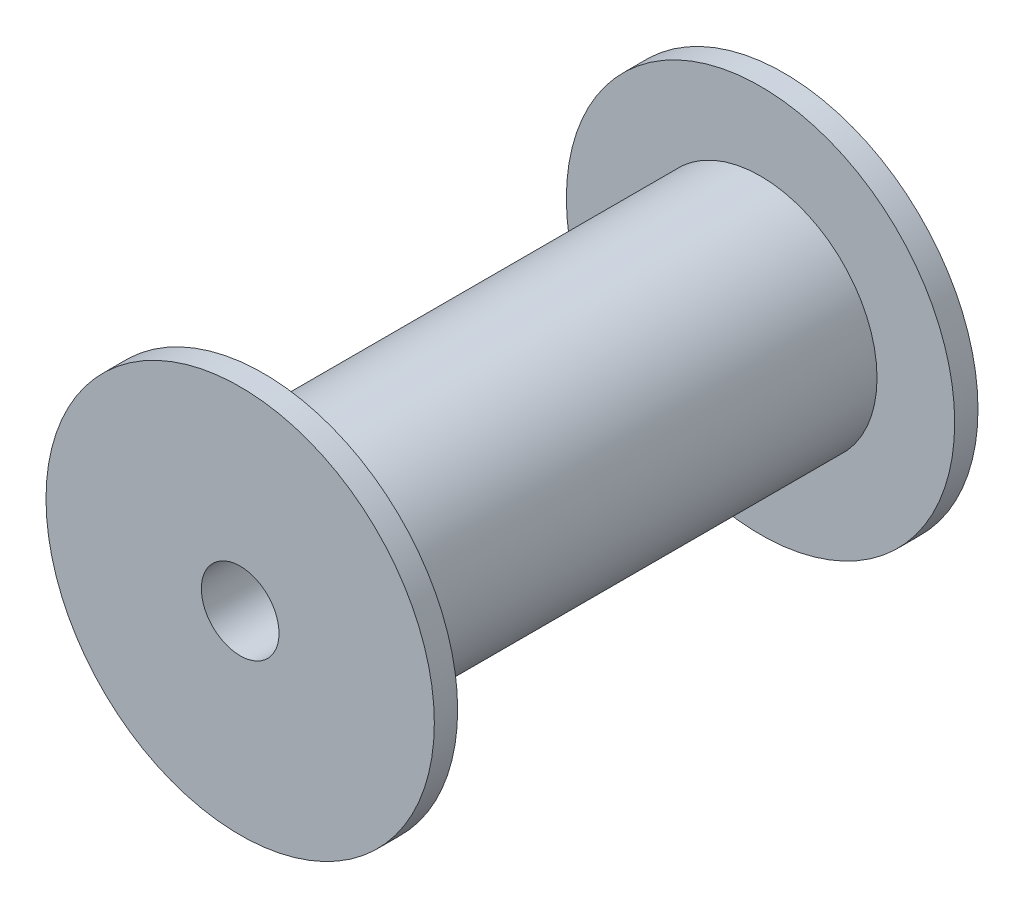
ISO-10303-21;
HEADER;
FILE_DESCRIPTION(('STEP AP214'),'2;1');
FILE_NAME('part.step','',(''),(''),'','','');
FILE_SCHEMA(('AUTOMOTIVE_DESIGN { 1 0 10303 214 1 1 1 1 }'));
ENDSEC;
DATA;
#1=APPLICATION_CONTEXT('core data for automotive mechanical design processes');
#2=APPLICATION_PROTOCOL_DEFINITION('international standard','automotive_design',2000,#1);
#3=PRODUCT_CONTEXT('',#1,'mechanical');
#4=PRODUCT('Part','Part','',(#3));
#5=PRODUCT_RELATED_PRODUCT_CATEGORY('part','',(#4));
#6=PRODUCT_DEFINITION_FORMATION('','',#4);
#7=PRODUCT_DEFINITION_CONTEXT('part definition',#1,'design');
#8=PRODUCT_DEFINITION('design','',#6,#7);
#9=PRODUCT_DEFINITION_SHAPE('','',#8);
#10=(LENGTH_UNIT() NAMED_UNIT(*) SI_UNIT(.MILLI.,.METRE.));
#11=(NAMED_UNIT(*) PLANE_ANGLE_UNIT() SI_UNIT($,.RADIAN.));
#12=(NAMED_UNIT(*) SI_UNIT($,.STERADIAN.) SOLID_ANGLE_UNIT());
#13=UNCERTAINTY_MEASURE_WITH_UNIT(LENGTH_MEASURE(1.E-05),#10,'distance_accuracy_value','');
#14=(GEOMETRIC_REPRESENTATION_CONTEXT(3) GLOBAL_UNCERTAINTY_ASSIGNED_CONTEXT((#13)) GLOBAL_UNIT_ASSIGNED_CONTEXT((#10,
#11,#12)) REPRESENTATION_CONTEXT('',''));
#15=CARTESIAN_POINT('',(0.,0.,0.));
#16=DIRECTION('',(0.,0.,1.));
#17=DIRECTION('',(1.,0.,0.));
#18=AXIS2_PLACEMENT_3D('',#15,#16,#17);
#19=CARTESIAN_POINT('',(-425.099999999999,64.9999999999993,-49.9999999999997));
#20=DIRECTION('',(0.,0.,0.999999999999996));
#21=DIRECTION('',(1.,0.,0.));
#22=AXIS2_PLACEMENT_3D('',#19,#20,#21);
#23=CYLINDRICAL_SURFACE('',#22,15.);
#24=CARTESIAN_POINT('',(-425.099999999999,64.9999999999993,-41.4999999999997));
#25=DIRECTION('',(0.,0.,0.999999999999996));
#26=DIRECTION('',(1.,0.,0.));
#27=AXIS2_PLACEMENT_3D('',#24,#25,#26);
#28=CIRCLE('',#27,15.);
#29=CARTESIAN_POINT('',(-410.099999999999,64.9999999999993,-41.4999999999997));
#30=VERTEX_POINT('',#29);
#31=EDGE_CURVE('E11',#30,#30,#28,.F.);
#32=CARTESIAN_POINT('',(-425.099999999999,64.9999999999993,22.4999999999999));
#33=DIRECTION('',(0.,0.,0.999999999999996));
#34=DIRECTION('',(1.,0.,0.));
#35=AXIS2_PLACEMENT_3D('',#32,#33,#34);
#36=CIRCLE('',#35,15.);
#37=CARTESIAN_POINT('',(-410.099999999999,64.9999999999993,22.4999999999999));
#38=VERTEX_POINT('',#37);
#39=EDGE_CURVE('E81',#38,#38,#36,.F.);
#40=CARTESIAN_POINT('',(-410.099999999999,64.9999999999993,-41.4999999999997));
#41=CARTESIAN_POINT('',(-410.099999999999,64.9999999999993,-40.8333333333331));
#42=CARTESIAN_POINT('',(-410.099999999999,64.9999999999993,-40.1666666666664));
#43=CARTESIAN_POINT('',(-410.099999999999,64.9999999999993,-38.8333333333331));
#44=CARTESIAN_POINT('',(-410.099999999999,64.9999999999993,-38.1666666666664));
#45=CARTESIAN_POINT('',(-410.099999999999,64.9999999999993,-36.8333333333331));
#46=CARTESIAN_POINT('',(-410.099999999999,64.9999999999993,-36.1666666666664));
#47=CARTESIAN_POINT('',(-410.099999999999,64.9999999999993,-34.8333333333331));
#48=CARTESIAN_POINT('',(-410.099999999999,64.9999999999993,-34.1666666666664));
#49=CARTESIAN_POINT('',(-410.099999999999,64.9999999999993,-32.8333333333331));
#50=CARTESIAN_POINT('',(-410.099999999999,64.9999999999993,-32.1666666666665));
#51=CARTESIAN_POINT('',(-410.099999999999,64.9999999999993,-30.8333333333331));
#52=CARTESIAN_POINT('',(-410.099999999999,64.9999999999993,-30.1666666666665));
#53=CARTESIAN_POINT('',(-410.099999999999,64.9999999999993,-28.8333333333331));
#54=CARTESIAN_POINT('',(-410.099999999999,64.9999999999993,-28.1666666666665));
#55=CARTESIAN_POINT('',(-410.099999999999,64.9999999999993,-26.8333333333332));
#56=CARTESIAN_POINT('',(-410.099999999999,64.9999999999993,-26.1666666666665));
#57=CARTESIAN_POINT('',(-410.099999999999,64.9999999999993,-24.8333333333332));
#58=CARTESIAN_POINT('',(-410.099999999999,64.9999999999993,-24.1666666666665));
#59=CARTESIAN_POINT('',(-410.099999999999,64.9999999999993,-22.8333333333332));
#60=CARTESIAN_POINT('',(-410.099999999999,64.9999999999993,-22.1666666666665));
#61=CARTESIAN_POINT('',(-410.099999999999,64.9999999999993,-20.8333333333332));
#62=CARTESIAN_POINT('',(-410.099999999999,64.9999999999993,-20.1666666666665));
#63=CARTESIAN_POINT('',(-410.099999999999,64.9999999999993,-18.8333333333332));
#64=CARTESIAN_POINT('',(-410.099999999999,64.9999999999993,-18.1666666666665));
#65=CARTESIAN_POINT('',(-410.099999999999,64.9999999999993,-16.8333333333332));
#66=CARTESIAN_POINT('',(-410.099999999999,64.9999999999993,-16.1666666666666));
#67=CARTESIAN_POINT('',(-410.099999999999,64.9999999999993,-14.8333333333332));
#68=CARTESIAN_POINT('',(-410.099999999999,64.9999999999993,-14.1666666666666));
#69=CARTESIAN_POINT('',(-410.099999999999,64.9999999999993,-12.8333333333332));
#70=CARTESIAN_POINT('',(-410.099999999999,64.9999999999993,-12.1666666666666));
#71=CARTESIAN_POINT('',(-410.099999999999,64.9999999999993,-10.8333333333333));
#72=CARTESIAN_POINT('',(-410.099999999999,64.9999999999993,-10.1666666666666));
#73=CARTESIAN_POINT('',(-410.099999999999,64.9999999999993,-8.83333333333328));
#74=CARTESIAN_POINT('',(-410.099999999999,64.9999999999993,-8.16666666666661));
#75=CARTESIAN_POINT('',(-410.099999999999,64.9999999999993,-6.83333333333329));
#76=CARTESIAN_POINT('',(-410.099999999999,64.9999999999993,-6.16666666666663));
#77=CARTESIAN_POINT('',(-410.099999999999,64.9999999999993,-4.8333333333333));
#78=CARTESIAN_POINT('',(-410.099999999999,64.9999999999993,-4.16666666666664));
#79=CARTESIAN_POINT('',(-410.099999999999,64.9999999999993,-2.83333333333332));
#80=CARTESIAN_POINT('',(-410.099999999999,64.9999999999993,-2.16666666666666));
#81=CARTESIAN_POINT('',(-410.099999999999,64.9999999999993,-0.833333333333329));
#82=CARTESIAN_POINT('',(-410.099999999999,64.9999999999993,-0.166666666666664));
#83=CARTESIAN_POINT('',(-410.099999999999,64.9999999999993,1.16666666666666));
#84=CARTESIAN_POINT('',(-410.099999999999,64.9999999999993,1.83333333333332));
#85=CARTESIAN_POINT('',(-410.099999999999,64.9999999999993,3.16666666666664));
#86=CARTESIAN_POINT('',(-410.099999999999,64.9999999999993,3.83333333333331));
#87=CARTESIAN_POINT('',(-410.099999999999,64.9999999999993,5.16666666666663));
#88=CARTESIAN_POINT('',(-410.099999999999,64.9999999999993,5.83333333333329));
#89=CARTESIAN_POINT('',(-410.099999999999,64.9999999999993,7.16666666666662));
#90=CARTESIAN_POINT('',(-410.099999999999,64.9999999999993,7.83333333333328));
#91=CARTESIAN_POINT('',(-410.099999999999,64.9999999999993,9.16666666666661));
#92=CARTESIAN_POINT('',(-410.099999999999,64.9999999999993,9.83333333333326));
#93=CARTESIAN_POINT('',(-410.099999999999,64.9999999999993,11.1666666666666));
#94=CARTESIAN_POINT('',(-410.099999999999,64.9999999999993,11.8333333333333));
#95=CARTESIAN_POINT('',(-410.099999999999,64.9999999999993,13.1666666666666));
#96=CARTESIAN_POINT('',(-410.099999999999,64.9999999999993,13.8333333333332));
#97=CARTESIAN_POINT('',(-410.099999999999,64.9999999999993,15.1666666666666));
#98=CARTESIAN_POINT('',(-410.099999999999,64.9999999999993,15.8333333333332));
#99=CARTESIAN_POINT('',(-410.099999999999,64.9999999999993,17.1666666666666));
#100=CARTESIAN_POINT('',(-410.099999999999,64.9999999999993,17.8333333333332));
#101=CARTESIAN_POINT('',(-410.099999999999,64.9999999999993,19.1666666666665));
#102=CARTESIAN_POINT('',(-410.099999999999,64.9999999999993,19.8333333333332));
#103=CARTESIAN_POINT('',(-410.099999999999,64.9999999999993,21.1666666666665));
#104=CARTESIAN_POINT('',(-410.099999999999,64.9999999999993,21.8333333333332));
#105=CARTESIAN_POINT('',(-410.099999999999,64.9999999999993,22.4999999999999));
#106=B_SPLINE_CURVE_WITH_KNOTS('',3,(#40,#41,#42,#43,#44,#45,#46,#47,#48,#49,#50,#51,#52,#53,
#54,#55,#56,#57,#58,#59,#60,#61,#62,#63,#64,#65,#66,#67,#68,#69,#70,#71,#72,#73,#74,#75,#76,#77,
#78,#79,#80,#81,#82,#83,#84,#85,#86,#87,#88,#89,#90,#91,#92,#93,#94,#95,#96,#97,#98,#99,#100,
#101,#102,#103,#104,#105),.UNSPECIFIED.,.F.,.F.,(4,2,2,2,2,2,2,2,2,2,2,2,2,2,2,2,2,2,2,2,2,2,2,
2,2,2,2,2,2,2,2,2,4),(0.,1.99999999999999,3.99999999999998,5.99999999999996,7.99999999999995,
9.99999999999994,11.9999999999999,13.9999999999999,15.9999999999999,17.9999999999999,
19.9999999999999,21.9999999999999,23.9999999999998,25.9999999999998,27.9999999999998,
29.9999999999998,31.9999999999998,33.9999999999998,35.9999999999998,37.9999999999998,
39.9999999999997,41.9999999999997,43.9999999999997,45.9999999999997,47.9999999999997,
49.9999999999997,51.9999999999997,53.9999999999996,55.9999999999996,57.9999999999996,
59.9999999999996,61.9999999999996,63.9999999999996),.UNSPECIFIED.);
#107=EDGE_CURVE('BSEAM62',#30,#38,#106,.T.);
#108=ORIENTED_EDGE('',*,*,#31,.F.);
#109=ORIENTED_EDGE('',*,*,#39,.T.);
#110=ORIENTED_EDGE('',*,*,#107,.T.);
#111=ORIENTED_EDGE('',*,*,#107,.F.);
#112=EDGE_LOOP('',(#108,#110,#109,#111));
#113=FACE_BOUND('',#112,.T.);
#114=ADVANCED_FACE('F62',(#113),#23,.T.);
#115=CARTESIAN_POINT('',(-425.099999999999,64.9999999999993,-49.9999999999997));
#116=DIRECTION('',(0.,0.,0.999999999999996));
#117=DIRECTION('',(1.,0.,0.));
#118=AXIS2_PLACEMENT_3D('',#115,#116,#117);
#119=CIRCLE('',#118,15.);
#120=CARTESIAN_POINT('',(-410.099999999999,64.9999999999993,-49.9999999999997));
#121=VERTEX_POINT('',#120);
#122=EDGE_CURVE('E70',#121,#121,#119,.T.);
#123=CARTESIAN_POINT('',(-425.099999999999,64.9999999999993,-44.4999999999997));
#124=DIRECTION('',(0.,0.,0.999999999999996));
#125=DIRECTION('',(1.,0.,0.));
#126=AXIS2_PLACEMENT_3D('',#123,#124,#125);
#127=CIRCLE('',#126,15.);
#128=CARTESIAN_POINT('',(-410.099999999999,64.9999999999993,-44.4999999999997));
#129=VERTEX_POINT('',#128);
#130=EDGE_CURVE('E75',#129,#129,#127,.F.);
#131=CARTESIAN_POINT('',(-410.099999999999,64.9999999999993,-49.9999999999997));
#132=CARTESIAN_POINT('',(-410.099999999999,64.9999999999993,-49.9427083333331));
#133=CARTESIAN_POINT('',(-410.099999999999,64.9999999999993,-49.8854166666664));
#134=CARTESIAN_POINT('',(-410.099999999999,64.9999999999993,-49.7708333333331));
#135=CARTESIAN_POINT('',(-410.099999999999,64.9999999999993,-49.7135416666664));
#136=CARTESIAN_POINT('',(-410.099999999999,64.9999999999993,-49.5989583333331));
#137=CARTESIAN_POINT('',(-410.099999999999,64.9999999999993,-49.5416666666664));
#138=CARTESIAN_POINT('',(-410.099999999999,64.9999999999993,-49.4270833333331));
#139=CARTESIAN_POINT('',(-410.099999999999,64.9999999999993,-49.3697916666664));
#140=CARTESIAN_POINT('',(-410.099999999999,64.9999999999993,-49.2552083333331));
#141=CARTESIAN_POINT('',(-410.099999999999,64.9999999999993,-49.1979166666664));
#142=CARTESIAN_POINT('',(-410.099999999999,64.9999999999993,-49.0833333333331));
#143=CARTESIAN_POINT('',(-410.099999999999,64.9999999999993,-49.0260416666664));
#144=CARTESIAN_POINT('',(-410.099999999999,64.9999999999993,-48.9114583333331));
#145=CARTESIAN_POINT('',(-410.099999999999,64.9999999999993,-48.8541666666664));
#146=CARTESIAN_POINT('',(-410.099999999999,64.9999999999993,-48.7395833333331));
#147=CARTESIAN_POINT('',(-410.099999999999,64.9999999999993,-48.6822916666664));
#148=CARTESIAN_POINT('',(-410.099999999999,64.9999999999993,-48.5677083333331));
#149=CARTESIAN_POINT('',(-410.099999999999,64.9999999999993,-48.5104166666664));
#150=CARTESIAN_POINT('',(-410.099999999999,64.9999999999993,-48.3958333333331));
#151=CARTESIAN_POINT('',(-410.099999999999,64.9999999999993,-48.3385416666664));
#152=CARTESIAN_POINT('',(-410.099999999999,64.9999999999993,-48.2239583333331));
#153=CARTESIAN_POINT('',(-410.099999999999,64.9999999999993,-48.1666666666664));
#154=CARTESIAN_POINT('',(-410.099999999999,64.9999999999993,-48.0520833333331));
#155=CARTESIAN_POINT('',(-410.099999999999,64.9999999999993,-47.9947916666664));
#156=CARTESIAN_POINT('',(-410.099999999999,64.9999999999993,-47.8802083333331));
#157=CARTESIAN_POINT('',(-410.099999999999,64.9999999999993,-47.8229166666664));
#158=CARTESIAN_POINT('',(-410.099999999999,64.9999999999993,-47.7083333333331));
#159=CARTESIAN_POINT('',(-410.099999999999,64.9999999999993,-47.6510416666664));
#160=CARTESIAN_POINT('',(-410.099999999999,64.9999999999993,-47.5364583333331));
#161=CARTESIAN_POINT('',(-410.099999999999,64.9999999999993,-47.4791666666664));
#162=CARTESIAN_POINT('',(-410.099999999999,64.9999999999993,-47.3645833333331));
#163=CARTESIAN_POINT('',(-410.099999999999,64.9999999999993,-47.3072916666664));
#164=CARTESIAN_POINT('',(-410.099999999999,64.9999999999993,-47.1927083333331));
#165=CARTESIAN_POINT('',(-410.099999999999,64.9999999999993,-47.1354166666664));
#166=CARTESIAN_POINT('',(-410.099999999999,64.9999999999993,-47.0208333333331));
#167=CARTESIAN_POINT('',(-410.099999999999,64.9999999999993,-46.9635416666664));
#168=CARTESIAN_POINT('',(-410.099999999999,64.9999999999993,-46.8489583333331));
#169=CARTESIAN_POINT('',(-410.099999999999,64.9999999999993,-46.7916666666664));
#170=CARTESIAN_POINT('',(-410.099999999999,64.9999999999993,-46.6770833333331));
#171=CARTESIAN_POINT('',(-410.099999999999,64.9999999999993,-46.6197916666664));
#172=CARTESIAN_POINT('',(-410.099999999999,64.9999999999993,-46.5052083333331));
#173=CARTESIAN_POINT('',(-410.099999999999,64.9999999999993,-46.4479166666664));
#174=CARTESIAN_POINT('',(-410.099999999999,64.9999999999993,-46.3333333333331));
#175=CARTESIAN_POINT('',(-410.099999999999,64.9999999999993,-46.2760416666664));
#176=CARTESIAN_POINT('',(-410.099999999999,64.9999999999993,-46.1614583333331));
#177=CARTESIAN_POINT('',(-410.099999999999,64.9999999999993,-46.1041666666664));
#178=CARTESIAN_POINT('',(-410.099999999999,64.9999999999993,-45.9895833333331));
#179=CARTESIAN_POINT('',(-410.099999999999,64.9999999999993,-45.9322916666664));
#180=CARTESIAN_POINT('',(-410.099999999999,64.9999999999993,-45.8177083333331));
#181=CARTESIAN_POINT('',(-410.099999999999,64.9999999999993,-45.7604166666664));
#182=CARTESIAN_POINT('',(-410.099999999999,64.9999999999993,-45.6458333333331));
#183=CARTESIAN_POINT('',(-410.099999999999,64.9999999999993,-45.5885416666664));
#184=CARTESIAN_POINT('',(-410.099999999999,64.9999999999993,-45.4739583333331));
#185=CARTESIAN_POINT('',(-410.099999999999,64.9999999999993,-45.4166666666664));
#186=CARTESIAN_POINT('',(-410.099999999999,64.9999999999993,-45.3020833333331));
#187=CARTESIAN_POINT('',(-410.099999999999,64.9999999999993,-45.2447916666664));
#188=CARTESIAN_POINT('',(-410.099999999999,64.9999999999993,-45.1302083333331));
#189=CARTESIAN_POINT('',(-410.099999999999,64.9999999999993,-45.0729166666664));
#190=CARTESIAN_POINT('',(-410.099999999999,64.9999999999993,-44.9583333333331));
#191=CARTESIAN_POINT('',(-410.099999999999,64.9999999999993,-44.9010416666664));
#192=CARTESIAN_POINT('',(-410.099999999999,64.9999999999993,-44.7864583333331));
#193=CARTESIAN_POINT('',(-410.099999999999,64.9999999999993,-44.7291666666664));
#194=CARTESIAN_POINT('',(-410.099999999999,64.9999999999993,-44.6145833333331));
#195=CARTESIAN_POINT('',(-410.099999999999,64.9999999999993,-44.5572916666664));
#196=CARTESIAN_POINT('',(-410.099999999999,64.9999999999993,-44.4999999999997));
#197=B_SPLINE_CURVE_WITH_KNOTS('',3,(#131,#132,#133,#134,#135,#136,#137,#138,#139,#140,#141,
#142,#143,#144,#145,#146,#147,#148,#149,#150,#151,#152,#153,#154,#155,#156,#157,#158,#159,#160,
#161,#162,#163,#164,#165,#166,#167,#168,#169,#170,#171,#172,#173,#174,#175,#176,#177,#178,#179,
#180,#181,#182,#183,#184,#185,#186,#187,#188,#189,#190,#191,#192,#193,#194,#195,#196),
.UNSPECIFIED.,.F.,.F.,(4,2,2,2,2,2,2,2,2,2,2,2,2,2,2,2,2,2,2,2,2,2,2,2,2,2,2,2,2,2,2,2,4),(0.,
0.171875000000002,0.343750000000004,0.515625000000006,0.687500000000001,0.859375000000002,
1.03125,1.20312500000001,1.37500000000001,1.546875,1.71875,1.89062500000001,2.0625,2.234375,
2.40625000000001,2.57812500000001,2.75000000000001,2.921875,3.09375000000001,3.26562500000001,
3.4375,3.609375,3.78125000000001,3.95312500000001,4.12500000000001,4.29687500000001,
4.46875000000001,4.64062500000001,4.8125,4.98437500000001,5.15625000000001,5.32812500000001,
5.50000000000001),.UNSPECIFIED.);
#198=EDGE_CURVE('BSEAM120',#121,#129,#197,.T.);
#199=ORIENTED_EDGE('',*,*,#122,.T.);
#200=ORIENTED_EDGE('',*,*,#130,.T.);
#201=ORIENTED_EDGE('',*,*,#198,.T.);
#202=ORIENTED_EDGE('',*,*,#198,.F.);
#203=EDGE_LOOP('',(#199,#201,#200,#202));
#204=FACE_BOUND('',#203,.T.);
#205=ADVANCED_FACE('F120',(#204),#23,.T.);
#206=CARTESIAN_POINT('',(-425.099999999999,64.9999999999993,-49.9999999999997));
#207=DIRECTION('',(0.,0.,0.999999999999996));
#208=DIRECTION('',(1.,0.,0.));
#209=AXIS2_PLACEMENT_3D('',#206,#207,#208);
#210=PLANE('',#209);
#211=CARTESIAN_POINT('',(-425.099999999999,64.9999999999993,-49.9999999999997));
#212=DIRECTION('',(0.,0.,0.999999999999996));
#213=DIRECTION('',(1.,0.,0.));
#214=AXIS2_PLACEMENT_3D('',#211,#212,#213);
#215=CIRCLE('',#214,13.);
#216=CARTESIAN_POINT('',(-412.099999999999,64.9999999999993,-49.9999999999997));
#217=VERTEX_POINT('',#216);
#218=EDGE_CURVE('E165',#217,#217,#215,.T.);
#219=ORIENTED_EDGE('',*,*,#218,.T.);
#220=EDGE_LOOP('',(#219));
#221=FACE_BOUND('',#220,.T.);
#222=ORIENTED_EDGE('',*,*,#122,.F.);
#223=EDGE_LOOP('',(#222));
#224=FACE_BOUND('',#223,.T.);
#225=ADVANCED_FACE('F64',(#221,#224),#210,.F.);
#226=CARTESIAN_POINT('',(-425.099999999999,64.9999999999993,-44.4999999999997));
#227=DIRECTION('',(0.,0.,0.999999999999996));
#228=DIRECTION('',(1.,0.,0.));
#229=AXIS2_PLACEMENT_3D('',#226,#227,#228);
#230=PLANE('',#229);
#231=ORIENTED_EDGE('',*,*,#130,.F.);
#232=EDGE_LOOP('',(#231));
#233=FACE_BOUND('',#232,.T.);
#234=CARTESIAN_POINT('',(-425.099999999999,64.9999999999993,-44.4999999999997));
#235=DIRECTION('',(0.,0.,0.999999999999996));
#236=DIRECTION('',(1.,0.,0.));
#237=AXIS2_PLACEMENT_3D('',#234,#235,#236);
#238=CIRCLE('',#237,25.);
#239=CARTESIAN_POINT('',(-400.099999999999,64.9999999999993,-44.4999999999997));
#240=VERTEX_POINT('',#239);
#241=EDGE_CURVE('E83',#240,#240,#238,.T.);
#242=ORIENTED_EDGE('',*,*,#241,.F.);
#243=EDGE_LOOP('',(#242));
#244=FACE_BOUND('',#243,.T.);
#245=ADVANCED_FACE('F110',(#233,#244),#230,.F.);
#246=CARTESIAN_POINT('',(-425.099999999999,64.9999999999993,-41.4999999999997));
#247=DIRECTION('',(0.,0.,0.999999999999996));
#248=DIRECTION('',(1.,0.,0.));
#249=AXIS2_PLACEMENT_3D('',#246,#247,#248);
#250=PLANE('',#249);
#251=ORIENTED_EDGE('',*,*,#31,.T.);
#252=EDGE_LOOP('',(#251));
#253=FACE_BOUND('',#252,.T.);
#254=CARTESIAN_POINT('',(-425.099999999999,64.9999999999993,-41.4999999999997));
#255=DIRECTION('',(0.,0.,0.999999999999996));
#256=DIRECTION('',(1.,0.,0.));
#257=AXIS2_PLACEMENT_3D('',#254,#255,#256);
#258=CIRCLE('',#257,25.);
#259=CARTESIAN_POINT('',(-400.099999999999,64.9999999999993,-41.4999999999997));
#260=VERTEX_POINT('',#259);
#261=EDGE_CURVE('E80',#260,#260,#258,.T.);
#262=ORIENTED_EDGE('',*,*,#261,.T.);
#263=EDGE_LOOP('',(#262));
#264=FACE_BOUND('',#263,.T.);
#265=ADVANCED_FACE('F101',(#253,#264),#250,.T.);
#266=CARTESIAN_POINT('',(-425.099999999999,64.9999999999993,-44.4999999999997));
#267=DIRECTION('',(0.,0.,0.999999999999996));
#268=DIRECTION('',(1.,0.,0.));
#269=AXIS2_PLACEMENT_3D('',#266,#267,#268);
#270=CYLINDRICAL_SURFACE('',#269,25.);
#271=CARTESIAN_POINT('',(-400.099999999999,64.9999999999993,-41.4999999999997));
#272=CARTESIAN_POINT('',(-400.099999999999,64.9999999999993,-41.5312499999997));
#273=CARTESIAN_POINT('',(-400.099999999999,64.9999999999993,-41.5624999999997));
#274=CARTESIAN_POINT('',(-400.099999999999,64.9999999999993,-41.6249999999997));
#275=CARTESIAN_POINT('',(-400.099999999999,64.9999999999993,-41.6562499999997));
#276=CARTESIAN_POINT('',(-400.099999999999,64.9999999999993,-41.7187499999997));
#277=CARTESIAN_POINT('',(-400.099999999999,64.9999999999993,-41.7499999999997));
#278=CARTESIAN_POINT('',(-400.099999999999,64.9999999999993,-41.8124999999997));
#279=CARTESIAN_POINT('',(-400.099999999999,64.9999999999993,-41.8437499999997));
#280=CARTESIAN_POINT('',(-400.099999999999,64.9999999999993,-41.9062499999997));
#281=CARTESIAN_POINT('',(-400.099999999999,64.9999999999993,-41.9374999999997));
#282=CARTESIAN_POINT('',(-400.099999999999,64.9999999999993,-41.9999999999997));
#283=CARTESIAN_POINT('',(-400.099999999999,64.9999999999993,-42.0312499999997));
#284=CARTESIAN_POINT('',(-400.099999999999,64.9999999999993,-42.0937499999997));
#285=CARTESIAN_POINT('',(-400.099999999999,64.9999999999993,-42.1249999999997));
#286=CARTESIAN_POINT('',(-400.099999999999,64.9999999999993,-42.1874999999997));
#287=CARTESIAN_POINT('',(-400.099999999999,64.9999999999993,-42.2187499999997));
#288=CARTESIAN_POINT('',(-400.099999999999,64.9999999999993,-42.2812499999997));
#289=CARTESIAN_POINT('',(-400.099999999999,64.9999999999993,-42.3124999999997));
#290=CARTESIAN_POINT('',(-400.099999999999,64.9999999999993,-42.3749999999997));
#291=CARTESIAN_POINT('',(-400.099999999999,64.9999999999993,-42.4062499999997));
#292=CARTESIAN_POINT('',(-400.099999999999,64.9999999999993,-42.4687499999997));
#293=CARTESIAN_POINT('',(-400.099999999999,64.9999999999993,-42.4999999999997));
#294=CARTESIAN_POINT('',(-400.099999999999,64.9999999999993,-42.5624999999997));
#295=CARTESIAN_POINT('',(-400.099999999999,64.9999999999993,-42.5937499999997));
#296=CARTESIAN_POINT('',(-400.099999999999,64.9999999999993,-42.6562499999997));
#297=CARTESIAN_POINT('',(-400.099999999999,64.9999999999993,-42.6874999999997));
#298=CARTESIAN_POINT('',(-400.099999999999,64.9999999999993,-42.7499999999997));
#299=CARTESIAN_POINT('',(-400.099999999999,64.9999999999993,-42.7812499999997));
#300=CARTESIAN_POINT('',(-400.099999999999,64.9999999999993,-42.8437499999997));
#301=CARTESIAN_POINT('',(-400.099999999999,64.9999999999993,-42.8749999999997));
#302=CARTESIAN_POINT('',(-400.099999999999,64.9999999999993,-42.9374999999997));
#303=CARTESIAN_POINT('',(-400.099999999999,64.9999999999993,-42.9687499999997));
#304=CARTESIAN_POINT('',(-400.099999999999,64.9999999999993,-43.0312499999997));
#305=CARTESIAN_POINT('',(-400.099999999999,64.9999999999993,-43.0624999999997));
#306=CARTESIAN_POINT('',(-400.099999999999,64.9999999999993,-43.1249999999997));
#307=CARTESIAN_POINT('',(-400.099999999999,64.9999999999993,-43.1562499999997));
#308=CARTESIAN_POINT('',(-400.099999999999,64.9999999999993,-43.2187499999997));
#309=CARTESIAN_POINT('',(-400.099999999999,64.9999999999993,-43.2499999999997));
#310=CARTESIAN_POINT('',(-400.099999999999,64.9999999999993,-43.3124999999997));
#311=CARTESIAN_POINT('',(-400.099999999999,64.9999999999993,-43.3437499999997));
#312=CARTESIAN_POINT('',(-400.099999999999,64.9999999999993,-43.4062499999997));
#313=CARTESIAN_POINT('',(-400.099999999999,64.9999999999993,-43.4374999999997));
#314=CARTESIAN_POINT('',(-400.099999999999,64.9999999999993,-43.4999999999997));
#315=CARTESIAN_POINT('',(-400.099999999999,64.9999999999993,-43.5312499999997));
#316=CARTESIAN_POINT('',(-400.099999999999,64.9999999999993,-43.5937499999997));
#317=CARTESIAN_POINT('',(-400.099999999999,64.9999999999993,-43.6249999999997));
#318=CARTESIAN_POINT('',(-400.099999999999,64.9999999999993,-43.6874999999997));
#319=CARTESIAN_POINT('',(-400.099999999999,64.9999999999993,-43.7187499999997));
#320=CARTESIAN_POINT('',(-400.099999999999,64.9999999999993,-43.7812499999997));
#321=CARTESIAN_POINT('',(-400.099999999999,64.9999999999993,-43.8124999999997));
#322=CARTESIAN_POINT('',(-400.099999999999,64.9999999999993,-43.8749999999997));
#323=CARTESIAN_POINT('',(-400.099999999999,64.9999999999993,-43.9062499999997));
#324=CARTESIAN_POINT('',(-400.099999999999,64.9999999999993,-43.9687499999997));
#325=CARTESIAN_POINT('',(-400.099999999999,64.9999999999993,-43.9999999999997));
#326=CARTESIAN_POINT('',(-400.099999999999,64.9999999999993,-44.0624999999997));
#327=CARTESIAN_POINT('',(-400.099999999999,64.9999999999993,-44.0937499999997));
#328=CARTESIAN_POINT('',(-400.099999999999,64.9999999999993,-44.1562499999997));
#329=CARTESIAN_POINT('',(-400.099999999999,64.9999999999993,-44.1874999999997));
#330=CARTESIAN_POINT('',(-400.099999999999,64.9999999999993,-44.2499999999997));
#331=CARTESIAN_POINT('',(-400.099999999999,64.9999999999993,-44.2812499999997));
#332=CARTESIAN_POINT('',(-400.099999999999,64.9999999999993,-44.3437499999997));
#333=CARTESIAN_POINT('',(-400.099999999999,64.9999999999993,-44.3749999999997));
#334=CARTESIAN_POINT('',(-400.099999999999,64.9999999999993,-44.4374999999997));
#335=CARTESIAN_POINT('',(-400.099999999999,64.9999999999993,-44.4687499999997));
#336=CARTESIAN_POINT('',(-400.099999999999,64.9999999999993,-44.4999999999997));
#337=B_SPLINE_CURVE_WITH_KNOTS('',3,(#271,#272,#273,#274,#275,#276,#277,#278,#279,#280,#281,
#282,#283,#284,#285,#286,#287,#288,#289,#290,#291,#292,#293,#294,#295,#296,#297,#298,#299,#300,
#301,#302,#303,#304,#305,#306,#307,#308,#309,#310,#311,#312,#313,#314,#315,#316,#317,#318,#319,
#320,#321,#322,#323,#324,#325,#326,#327,#328,#329,#330,#331,#332,#333,#334,#335,#336),
.UNSPECIFIED.,.F.,.F.,(4,2,2,2,2,2,2,2,2,2,2,2,2,2,2,2,2,2,2,2,2,2,2,2,2,2,2,2,2,2,2,2,4),(0.,
0.0937500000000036,0.1875,0.281250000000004,0.375,0.468750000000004,0.5625,0.656250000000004,
0.750000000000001,0.843750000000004,0.937500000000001,1.03125,1.125,1.21875,1.3125,1.40625,1.5,
1.59375,1.6875,1.78125,1.875,1.96875,2.0625,2.15625,2.25,2.34375,2.4375,2.53125,2.625,2.71875,
2.8125,2.90625,3.),.UNSPECIFIED.);
#338=EDGE_CURVE('BSEAM103',#260,#240,#337,.T.);
#339=ORIENTED_EDGE('',*,*,#261,.F.);
#340=ORIENTED_EDGE('',*,*,#241,.T.);
#341=ORIENTED_EDGE('',*,*,#338,.T.);
#342=ORIENTED_EDGE('',*,*,#338,.F.);
#343=EDGE_LOOP('',(#339,#341,#340,#342));
#344=FACE_BOUND('',#343,.T.);
#345=ADVANCED_FACE('F103',(#344),#270,.T.);
#346=CARTESIAN_POINT('',(-425.099999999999,64.9999999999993,22.4999999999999));
#347=DIRECTION('',(0.,0.,0.999999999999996));
#348=DIRECTION('',(1.,0.,0.));
#349=AXIS2_PLACEMENT_3D('',#346,#347,#348);
#350=PLANE('',#349);
#351=ORIENTED_EDGE('',*,*,#39,.F.);
#352=EDGE_LOOP('',(#351));
#353=FACE_BOUND('',#352,.T.);
#354=CARTESIAN_POINT('',(-425.099999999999,64.9999999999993,22.4999999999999));
#355=DIRECTION('',(0.,0.,0.999999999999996));
#356=DIRECTION('',(1.,0.,0.));
#357=AXIS2_PLACEMENT_3D('',#354,#355,#356);
#358=CIRCLE('',#357,25.);
#359=CARTESIAN_POINT('',(-400.099999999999,64.9999999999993,22.4999999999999));
#360=VERTEX_POINT('',#359);
#361=EDGE_CURVE('E90',#360,#360,#358,.T.);
#362=ORIENTED_EDGE('',*,*,#361,.F.);
#363=EDGE_LOOP('',(#362));
#364=FACE_BOUND('',#363,.T.);
#365=ADVANCED_FACE('F106',(#353,#364),#350,.F.);
#366=CARTESIAN_POINT('',(-425.099999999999,64.9999999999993,22.4999999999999));
#367=DIRECTION('',(0.,0.,0.999999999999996));
#368=DIRECTION('',(1.,0.,0.));
#369=AXIS2_PLACEMENT_3D('',#366,#367,#368);
#370=CYLINDRICAL_SURFACE('',#369,25.);
#371=CARTESIAN_POINT('',(-425.099999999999,64.9999999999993,25.4999999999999));
#372=DIRECTION('',(0.,0.,0.999999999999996));
#373=DIRECTION('',(1.,0.,0.));
#374=AXIS2_PLACEMENT_3D('',#371,#372,#373);
#375=CIRCLE('',#374,25.);
#376=CARTESIAN_POINT('',(-400.099999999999,64.9999999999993,25.4999999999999));
#377=VERTEX_POINT('',#376);
#378=EDGE_CURVE('E84',#377,#377,#375,.T.);
#379=CARTESIAN_POINT('',(-400.099999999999,64.9999999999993,25.4999999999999));
#380=CARTESIAN_POINT('',(-400.099999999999,64.9999999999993,25.4687499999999));
#381=CARTESIAN_POINT('',(-400.099999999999,64.9999999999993,25.4374999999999));
#382=CARTESIAN_POINT('',(-400.099999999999,64.9999999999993,25.3749999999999));
#383=CARTESIAN_POINT('',(-400.099999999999,64.9999999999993,25.3437499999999));
#384=CARTESIAN_POINT('',(-400.099999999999,64.9999999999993,25.2812499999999));
#385=CARTESIAN_POINT('',(-400.099999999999,64.9999999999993,25.2499999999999));
#386=CARTESIAN_POINT('',(-400.099999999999,64.9999999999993,25.1874999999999));
#387=CARTESIAN_POINT('',(-400.099999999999,64.9999999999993,25.1562499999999));
#388=CARTESIAN_POINT('',(-400.099999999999,64.9999999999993,25.0937499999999));
#389=CARTESIAN_POINT('',(-400.099999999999,64.9999999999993,25.0624999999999));
#390=CARTESIAN_POINT('',(-400.099999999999,64.9999999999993,24.9999999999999));
#391=CARTESIAN_POINT('',(-400.099999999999,64.9999999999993,24.9687499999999));
#392=CARTESIAN_POINT('',(-400.099999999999,64.9999999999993,24.9062499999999));
#393=CARTESIAN_POINT('',(-400.099999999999,64.9999999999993,24.8749999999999));
#394=CARTESIAN_POINT('',(-400.099999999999,64.9999999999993,24.8124999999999));
#395=CARTESIAN_POINT('',(-400.099999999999,64.9999999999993,24.7812499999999));
#396=CARTESIAN_POINT('',(-400.099999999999,64.9999999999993,24.7187499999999));
#397=CARTESIAN_POINT('',(-400.099999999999,64.9999999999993,24.6874999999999));
#398=CARTESIAN_POINT('',(-400.099999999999,64.9999999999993,24.6249999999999));
#399=CARTESIAN_POINT('',(-400.099999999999,64.9999999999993,24.5937499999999));
#400=CARTESIAN_POINT('',(-400.099999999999,64.9999999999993,24.5312499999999));
#401=CARTESIAN_POINT('',(-400.099999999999,64.9999999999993,24.4999999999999));
#402=CARTESIAN_POINT('',(-400.099999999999,64.9999999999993,24.4374999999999));
#403=CARTESIAN_POINT('',(-400.099999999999,64.9999999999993,24.4062499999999));
#404=CARTESIAN_POINT('',(-400.099999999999,64.9999999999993,24.3437499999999));
#405=CARTESIAN_POINT('',(-400.099999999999,64.9999999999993,24.3124999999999));
#406=CARTESIAN_POINT('',(-400.099999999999,64.9999999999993,24.2499999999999));
#407=CARTESIAN_POINT('',(-400.099999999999,64.9999999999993,24.2187499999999));
#408=CARTESIAN_POINT('',(-400.099999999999,64.9999999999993,24.1562499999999));
#409=CARTESIAN_POINT('',(-400.099999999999,64.9999999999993,24.1249999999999));
#410=CARTESIAN_POINT('',(-400.099999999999,64.9999999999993,24.0624999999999));
#411=CARTESIAN_POINT('',(-400.099999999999,64.9999999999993,24.0312499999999));
#412=CARTESIAN_POINT('',(-400.099999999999,64.9999999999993,23.9687499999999));
#413=CARTESIAN_POINT('',(-400.099999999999,64.9999999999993,23.9374999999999));
#414=CARTESIAN_POINT('',(-400.099999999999,64.9999999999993,23.8749999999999));
#415=CARTESIAN_POINT('',(-400.099999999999,64.9999999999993,23.8437499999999));
#416=CARTESIAN_POINT('',(-400.099999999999,64.9999999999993,23.7812499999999));
#417=CARTESIAN_POINT('',(-400.099999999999,64.9999999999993,23.7499999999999));
#418=CARTESIAN_POINT('',(-400.099999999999,64.9999999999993,23.6874999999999));
#419=CARTESIAN_POINT('',(-400.099999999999,64.9999999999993,23.6562499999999));
#420=CARTESIAN_POINT('',(-400.099999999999,64.9999999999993,23.5937499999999));
#421=CARTESIAN_POINT('',(-400.099999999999,64.9999999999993,23.5624999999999));
#422=CARTESIAN_POINT('',(-400.099999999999,64.9999999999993,23.4999999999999));
#423=CARTESIAN_POINT('',(-400.099999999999,64.9999999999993,23.4687499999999));
#424=CARTESIAN_POINT('',(-400.099999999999,64.9999999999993,23.4062499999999));
#425=CARTESIAN_POINT('',(-400.099999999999,64.9999999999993,23.3749999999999));
#426=CARTESIAN_POINT('',(-400.099999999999,64.9999999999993,23.3124999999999));
#427=CARTESIAN_POINT('',(-400.099999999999,64.9999999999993,23.2812499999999));
#428=CARTESIAN_POINT('',(-400.099999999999,64.9999999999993,23.2187499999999));
#429=CARTESIAN_POINT('',(-400.099999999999,64.9999999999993,23.1874999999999));
#430=CARTESIAN_POINT('',(-400.099999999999,64.9999999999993,23.1249999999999));
#431=CARTESIAN_POINT('',(-400.099999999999,64.9999999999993,23.0937499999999));
#432=CARTESIAN_POINT('',(-400.099999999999,64.9999999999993,23.0312499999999));
#433=CARTESIAN_POINT('',(-400.099999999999,64.9999999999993,22.9999999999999));
#434=CARTESIAN_POINT('',(-400.099999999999,64.9999999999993,22.9374999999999));
#435=CARTESIAN_POINT('',(-400.099999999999,64.9999999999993,22.9062499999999));
#436=CARTESIAN_POINT('',(-400.099999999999,64.9999999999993,22.8437499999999));
#437=CARTESIAN_POINT('',(-400.099999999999,64.9999999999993,22.8124999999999));
#438=CARTESIAN_POINT('',(-400.099999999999,64.9999999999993,22.7499999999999));
#439=CARTESIAN_POINT('',(-400.099999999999,64.9999999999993,22.7187499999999));
#440=CARTESIAN_POINT('',(-400.099999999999,64.9999999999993,22.6562499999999));
#441=CARTESIAN_POINT('',(-400.099999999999,64.9999999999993,22.6249999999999));
#442=CARTESIAN_POINT('',(-400.099999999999,64.9999999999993,22.5624999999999));
#443=CARTESIAN_POINT('',(-400.099999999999,64.9999999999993,22.5312499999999));
#444=CARTESIAN_POINT('',(-400.099999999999,64.9999999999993,22.4999999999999));
#445=B_SPLINE_CURVE_WITH_KNOTS('',3,(#379,#380,#381,#382,#383,#384,#385,#386,#387,#388,#389,
#390,#391,#392,#393,#394,#395,#396,#397,#398,#399,#400,#401,#402,#403,#404,#405,#406,#407,#408,
#409,#410,#411,#412,#413,#414,#415,#416,#417,#418,#419,#420,#421,#422,#423,#424,#425,#426,#427,
#428,#429,#430,#431,#432,#433,#434,#435,#436,#437,#438,#439,#440,#441,#442,#443,#444),
.UNSPECIFIED.,.F.,.F.,(4,2,2,2,2,2,2,2,2,2,2,2,2,2,2,2,2,2,2,2,2,2,2,2,2,2,2,2,2,2,2,2,4),(0.,
0.0937500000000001,0.1875,0.28125,0.375,0.46875,0.5625,0.656250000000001,0.750000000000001,
0.843750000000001,0.937500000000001,1.03125,1.125,1.21875,1.3125,1.40625,1.5,1.59375,1.6875,
1.78125,1.875,1.96875,2.0625,2.15625,2.25,2.34375,2.4375,2.53125,2.625,2.71875,2.8125,2.90625,
3.),.UNSPECIFIED.);
#446=EDGE_CURVE('BSEAM114',#377,#360,#445,.T.);
#447=ORIENTED_EDGE('',*,*,#378,.F.);
#448=ORIENTED_EDGE('',*,*,#361,.T.);
#449=ORIENTED_EDGE('',*,*,#446,.T.);
#450=ORIENTED_EDGE('',*,*,#446,.F.);
#451=EDGE_LOOP('',(#447,#449,#448,#450));
#452=FACE_BOUND('',#451,.T.);
#453=ADVANCED_FACE('F114',(#452),#370,.T.);
#454=CARTESIAN_POINT('',(-425.099999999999,64.9999999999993,25.4999999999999));
#455=DIRECTION('',(0.,0.,0.999999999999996));
#456=DIRECTION('',(1.,0.,0.));
#457=AXIS2_PLACEMENT_3D('',#454,#455,#456);
#458=PLANE('',#457);
#459=CARTESIAN_POINT('',(-425.099999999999,64.9999999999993,25.4999999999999));
#460=DIRECTION('',(0.,0.,0.999999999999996));
#461=DIRECTION('',(1.,0.,0.));
#462=AXIS2_PLACEMENT_3D('',#459,#460,#461);
#463=CIRCLE('',#462,5.);
#464=CARTESIAN_POINT('',(-420.099999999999,64.9999999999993,25.4999999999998));
#465=VERTEX_POINT('',#464);
#466=EDGE_CURVE('E95',#465,#465,#463,.T.);
#467=ORIENTED_EDGE('',*,*,#466,.F.);
#468=EDGE_LOOP('',(#467));
#469=FACE_BOUND('',#468,.T.);
#470=ORIENTED_EDGE('',*,*,#378,.T.);
#471=EDGE_LOOP('',(#470));
#472=FACE_BOUND('',#471,.T.);
#473=ADVANCED_FACE('F125',(#469,#472),#458,.T.);
#474=CARTESIAN_POINT('',(-425.099999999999,64.9999999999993,-49.9999999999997));
#475=DIRECTION('',(0.,0.,0.999999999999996));
#476=DIRECTION('',(1.,0.,0.));
#477=AXIS2_PLACEMENT_3D('',#474,#475,#476);
#478=CYLINDRICAL_SURFACE('',#477,5.);
#479=CARTESIAN_POINT('',(-425.099999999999,64.9999999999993,-41.9999999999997));
#480=DIRECTION('',(0.,0.,0.999999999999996));
#481=DIRECTION('',(1.,0.,0.));
#482=AXIS2_PLACEMENT_3D('',#479,#480,#481);
#483=CIRCLE('',#482,5.);
#484=CARTESIAN_POINT('',(-420.099999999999,64.9999999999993,-41.9999999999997));
#485=VERTEX_POINT('',#484);
#486=EDGE_CURVE('E66',#485,#485,#483,.F.);
#487=CARTESIAN_POINT('',(-420.099999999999,64.9999999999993,-41.9999999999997));
#488=CARTESIAN_POINT('',(-420.099999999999,64.9999999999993,-41.2968749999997));
#489=CARTESIAN_POINT('',(-420.099999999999,64.9999999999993,-40.5937499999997));
#490=CARTESIAN_POINT('',(-420.099999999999,64.9999999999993,-39.1874999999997));
#491=CARTESIAN_POINT('',(-420.099999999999,64.9999999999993,-38.4843749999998));
#492=CARTESIAN_POINT('',(-420.099999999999,64.9999999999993,-37.0781249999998));
#493=CARTESIAN_POINT('',(-420.099999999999,64.9999999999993,-36.3749999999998));
#494=CARTESIAN_POINT('',(-420.099999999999,64.9999999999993,-34.9687499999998));
#495=CARTESIAN_POINT('',(-420.099999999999,64.9999999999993,-34.2656249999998));
#496=CARTESIAN_POINT('',(-420.099999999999,64.9999999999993,-32.8593749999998));
#497=CARTESIAN_POINT('',(-420.099999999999,64.9999999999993,-32.1562499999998));
#498=CARTESIAN_POINT('',(-420.099999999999,64.9999999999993,-30.7499999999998));
#499=CARTESIAN_POINT('',(-420.099999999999,64.9999999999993,-30.0468749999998));
#500=CARTESIAN_POINT('',(-420.099999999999,64.9999999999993,-28.6406249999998));
#501=CARTESIAN_POINT('',(-420.099999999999,64.9999999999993,-27.9374999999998));
#502=CARTESIAN_POINT('',(-420.099999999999,64.9999999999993,-26.5312499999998));
#503=CARTESIAN_POINT('',(-420.099999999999,64.9999999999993,-25.8281249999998));
#504=CARTESIAN_POINT('',(-420.099999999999,64.9999999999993,-24.4218749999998));
#505=CARTESIAN_POINT('',(-420.099999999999,64.9999999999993,-23.7187499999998));
#506=CARTESIAN_POINT('',(-420.099999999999,64.9999999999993,-22.3124999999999));
#507=CARTESIAN_POINT('',(-420.099999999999,64.9999999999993,-21.6093749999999));
#508=CARTESIAN_POINT('',(-420.099999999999,64.9999999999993,-20.2031249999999));
#509=CARTESIAN_POINT('',(-420.099999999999,64.9999999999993,-19.4999999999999));
#510=CARTESIAN_POINT('',(-420.099999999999,64.9999999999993,-18.0937499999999));
#511=CARTESIAN_POINT('',(-420.099999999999,64.9999999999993,-17.3906249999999));
#512=CARTESIAN_POINT('',(-420.099999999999,64.9999999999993,-15.9843749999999));
#513=CARTESIAN_POINT('',(-420.099999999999,64.9999999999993,-15.2812499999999));
#514=CARTESIAN_POINT('',(-420.099999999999,64.9999999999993,-13.8749999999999));
#515=CARTESIAN_POINT('',(-420.099999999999,64.9999999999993,-13.1718749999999));
#516=CARTESIAN_POINT('',(-420.099999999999,64.9999999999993,-11.7656249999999));
#517=CARTESIAN_POINT('',(-420.099999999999,64.9999999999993,-11.0624999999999));
#518=CARTESIAN_POINT('',(-420.099999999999,64.9999999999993,-9.65624999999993));
#519=CARTESIAN_POINT('',(-420.099999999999,64.9999999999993,-8.95312499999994));
#520=CARTESIAN_POINT('',(-420.099999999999,64.9999999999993,-7.54687499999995));
#521=CARTESIAN_POINT('',(-420.099999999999,64.9999999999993,-6.84374999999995));
#522=CARTESIAN_POINT('',(-420.099999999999,64.9999999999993,-5.43749999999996));
#523=CARTESIAN_POINT('',(-420.099999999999,64.9999999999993,-4.73437499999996));
#524=CARTESIAN_POINT('',(-420.099999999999,64.9999999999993,-3.32812499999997));
#525=CARTESIAN_POINT('',(-420.099999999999,64.9999999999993,-2.62499999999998));
#526=CARTESIAN_POINT('',(-420.099999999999,64.9999999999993,-1.21874999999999));
#527=CARTESIAN_POINT('',(-420.099999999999,64.9999999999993,-0.515624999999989));
#528=CARTESIAN_POINT('',(-420.099999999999,64.9999999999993,0.890624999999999));
#529=CARTESIAN_POINT('',(-420.099999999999,64.9999999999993,1.59374999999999));
#530=CARTESIAN_POINT('',(-420.099999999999,64.9999999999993,2.99999999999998));
#531=CARTESIAN_POINT('',(-420.099999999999,64.9999999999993,3.70312499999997));
#532=CARTESIAN_POINT('',(-420.099999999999,64.9999999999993,5.10937499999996));
#533=CARTESIAN_POINT('',(-420.099999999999,64.9999999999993,5.81249999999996));
#534=CARTESIAN_POINT('',(-420.099999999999,64.9999999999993,7.21874999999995));
#535=CARTESIAN_POINT('',(-420.099999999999,64.9999999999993,7.92187499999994));
#536=CARTESIAN_POINT('',(-420.099999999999,64.9999999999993,9.32812499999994));
#537=CARTESIAN_POINT('',(-420.099999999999,64.9999999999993,10.0312499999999));
#538=CARTESIAN_POINT('',(-420.099999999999,64.9999999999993,11.4374999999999));
#539=CARTESIAN_POINT('',(-420.099999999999,64.9999999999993,12.1406249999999));
#540=CARTESIAN_POINT('',(-420.099999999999,64.9999999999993,13.5468749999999));
#541=CARTESIAN_POINT('',(-420.099999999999,64.9999999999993,14.2499999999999));
#542=CARTESIAN_POINT('',(-420.099999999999,64.9999999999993,15.6562499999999));
#543=CARTESIAN_POINT('',(-420.099999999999,64.9999999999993,16.3593749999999));
#544=CARTESIAN_POINT('',(-420.099999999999,64.9999999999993,17.7656249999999));
#545=CARTESIAN_POINT('',(-420.099999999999,64.9999999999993,18.4687499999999));
#546=CARTESIAN_POINT('',(-420.099999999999,64.9999999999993,19.8749999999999));
#547=CARTESIAN_POINT('',(-420.099999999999,64.9999999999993,20.5781249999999));
#548=CARTESIAN_POINT('',(-420.099999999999,64.9999999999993,21.9843749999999));
#549=CARTESIAN_POINT('',(-420.099999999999,64.9999999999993,22.6874999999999));
#550=CARTESIAN_POINT('',(-420.099999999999,64.9999999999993,24.0937499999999));
#551=CARTESIAN_POINT('',(-420.099999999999,64.9999999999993,24.7968749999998));
#552=CARTESIAN_POINT('',(-420.099999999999,64.9999999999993,25.4999999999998));
#553=B_SPLINE_CURVE_WITH_KNOTS('',3,(#487,#488,#489,#490,#491,#492,#493,#494,#495,#496,#497,
#498,#499,#500,#501,#502,#503,#504,#505,#506,#507,#508,#509,#510,#511,#512,#513,#514,#515,#516,
#517,#518,#519,#520,#521,#522,#523,#524,#525,#526,#527,#528,#529,#530,#531,#532,#533,#534,#535,
#536,#537,#538,#539,#540,#541,#542,#543,#544,#545,#546,#547,#548,#549,#550,#551,#552),
.UNSPECIFIED.,.F.,.F.,(4,2,2,2,2,2,2,2,2,2,2,2,2,2,2,2,2,2,2,2,2,2,2,2,2,2,2,2,2,2,2,2,4),(0.,
2.10937499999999,4.21874999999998,6.32812499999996,8.43749999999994,10.5468749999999,
12.6562499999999,14.7656249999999,16.8749999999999,18.9843749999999,21.0937499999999,
23.2031249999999,25.3124999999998,27.4218749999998,29.5312499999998,31.6406249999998,
33.7499999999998,35.8593749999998,37.9687499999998,40.0781249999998,42.1874999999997,
44.2968749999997,46.4062499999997,48.5156249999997,50.6249999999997,52.7343749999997,
54.8437499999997,56.9531249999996,59.0624999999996,61.1718749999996,63.2812499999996,
65.3906249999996,67.4999999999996),.UNSPECIFIED.);
#554=EDGE_CURVE('BSEAM135',#485,#465,#553,.T.);
#555=ORIENTED_EDGE('',*,*,#486,.T.);
#556=ORIENTED_EDGE('',*,*,#466,.T.);
#557=ORIENTED_EDGE('',*,*,#554,.T.);
#558=ORIENTED_EDGE('',*,*,#554,.F.);
#559=EDGE_LOOP('',(#555,#557,#556,#558));
#560=FACE_BOUND('',#559,.T.);
#561=ADVANCED_FACE('F135',(#560),#478,.F.);
#562=CARTESIAN_POINT('',(-425.099999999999,64.9999999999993,-41.9999999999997));
#563=DIRECTION('',(0.,0.,0.999999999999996));
#564=DIRECTION('',(1.,0.,0.));
#565=AXIS2_PLACEMENT_3D('',#562,#563,#564);
#566=PLANE('',#565);
#567=CARTESIAN_POINT('',(-425.099999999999,64.9999999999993,-41.9999999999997));
#568=DIRECTION('',(0.,0.,0.999999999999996));
#569=DIRECTION('',(1.,0.,0.));
#570=AXIS2_PLACEMENT_3D('',#567,#568,#569);
#571=CIRCLE('',#570,13.);
#572=CARTESIAN_POINT('',(-412.099999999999,64.9999999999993,-41.9999999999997));
#573=VERTEX_POINT('',#572);
#574=EDGE_CURVE('E162',#573,#573,#571,.T.);
#575=ORIENTED_EDGE('',*,*,#574,.F.);
#576=EDGE_LOOP('',(#575));
#577=FACE_BOUND('',#576,.T.);
#578=ORIENTED_EDGE('',*,*,#486,.F.);
#579=EDGE_LOOP('',(#578));
#580=FACE_BOUND('',#579,.T.);
#581=ADVANCED_FACE('F140',(#577,#580),#566,.F.);
#582=CARTESIAN_POINT('',(-425.099999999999,64.9999999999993,-49.9999999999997));
#583=DIRECTION('',(0.,0.,0.999999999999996));
#584=DIRECTION('',(1.,0.,0.));
#585=AXIS2_PLACEMENT_3D('',#582,#583,#584);
#586=CYLINDRICAL_SURFACE('',#585,13.);
#587=CARTESIAN_POINT('',(-412.099999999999,64.9999999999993,-41.9999999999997));
#588=CARTESIAN_POINT('',(-412.099999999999,64.9999999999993,-42.0833333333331));
#589=CARTESIAN_POINT('',(-412.099999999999,64.9999999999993,-42.1666666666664));
#590=CARTESIAN_POINT('',(-412.099999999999,64.9999999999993,-42.3333333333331));
#591=CARTESIAN_POINT('',(-412.099999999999,64.9999999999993,-42.4166666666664));
#592=CARTESIAN_POINT('',(-412.099999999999,64.9999999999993,-42.5833333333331));
#593=CARTESIAN_POINT('',(-412.099999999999,64.9999999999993,-42.6666666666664));
#594=CARTESIAN_POINT('',(-412.099999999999,64.9999999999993,-42.8333333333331));
#595=CARTESIAN_POINT('',(-412.099999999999,64.9999999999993,-42.9166666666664));
#596=CARTESIAN_POINT('',(-412.099999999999,64.9999999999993,-43.0833333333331));
#597=CARTESIAN_POINT('',(-412.099999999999,64.9999999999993,-43.1666666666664));
#598=CARTESIAN_POINT('',(-412.099999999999,64.9999999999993,-43.3333333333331));
#599=CARTESIAN_POINT('',(-412.099999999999,64.9999999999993,-43.4166666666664));
#600=CARTESIAN_POINT('',(-412.099999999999,64.9999999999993,-43.5833333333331));
#601=CARTESIAN_POINT('',(-412.099999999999,64.9999999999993,-43.6666666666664));
#602=CARTESIAN_POINT('',(-412.099999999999,64.9999999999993,-43.8333333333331));
#603=CARTESIAN_POINT('',(-412.099999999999,64.9999999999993,-43.9166666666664));
#604=CARTESIAN_POINT('',(-412.099999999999,64.9999999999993,-44.0833333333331));
#605=CARTESIAN_POINT('',(-412.099999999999,64.9999999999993,-44.1666666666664));
#606=CARTESIAN_POINT('',(-412.099999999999,64.9999999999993,-44.3333333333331));
#607=CARTESIAN_POINT('',(-412.099999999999,64.9999999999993,-44.4166666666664));
#608=CARTESIAN_POINT('',(-412.099999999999,64.9999999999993,-44.5833333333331));
#609=CARTESIAN_POINT('',(-412.099999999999,64.9999999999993,-44.6666666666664));
#610=CARTESIAN_POINT('',(-412.099999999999,64.9999999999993,-44.8333333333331));
#611=CARTESIAN_POINT('',(-412.099999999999,64.9999999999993,-44.9166666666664));
#612=CARTESIAN_POINT('',(-412.099999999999,64.9999999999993,-45.0833333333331));
#613=CARTESIAN_POINT('',(-412.099999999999,64.9999999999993,-45.1666666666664));
#614=CARTESIAN_POINT('',(-412.099999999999,64.9999999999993,-45.3333333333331));
#615=CARTESIAN_POINT('',(-412.099999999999,64.9999999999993,-45.4166666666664));
#616=CARTESIAN_POINT('',(-412.099999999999,64.9999999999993,-45.5833333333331));
#617=CARTESIAN_POINT('',(-412.099999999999,64.9999999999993,-45.6666666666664));
#618=CARTESIAN_POINT('',(-412.099999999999,64.9999999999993,-45.8333333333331));
#619=CARTESIAN_POINT('',(-412.099999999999,64.9999999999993,-45.9166666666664));
#620=CARTESIAN_POINT('',(-412.099999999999,64.9999999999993,-46.0833333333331));
#621=CARTESIAN_POINT('',(-412.099999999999,64.9999999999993,-46.1666666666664));
#622=CARTESIAN_POINT('',(-412.099999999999,64.9999999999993,-46.3333333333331));
#623=CARTESIAN_POINT('',(-412.099999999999,64.9999999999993,-46.4166666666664));
#624=CARTESIAN_POINT('',(-412.099999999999,64.9999999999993,-46.5833333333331));
#625=CARTESIAN_POINT('',(-412.099999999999,64.9999999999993,-46.6666666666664));
#626=CARTESIAN_POINT('',(-412.099999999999,64.9999999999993,-46.8333333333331));
#627=CARTESIAN_POINT('',(-412.099999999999,64.9999999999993,-46.9166666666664));
#628=CARTESIAN_POINT('',(-412.099999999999,64.9999999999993,-47.0833333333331));
#629=CARTESIAN_POINT('',(-412.099999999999,64.9999999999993,-47.1666666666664));
#630=CARTESIAN_POINT('',(-412.099999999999,64.9999999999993,-47.3333333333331));
#631=CARTESIAN_POINT('',(-412.099999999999,64.9999999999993,-47.4166666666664));
#632=CARTESIAN_POINT('',(-412.099999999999,64.9999999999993,-47.5833333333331));
#633=CARTESIAN_POINT('',(-412.099999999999,64.9999999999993,-47.6666666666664));
#634=CARTESIAN_POINT('',(-412.099999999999,64.9999999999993,-47.8333333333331));
#635=CARTESIAN_POINT('',(-412.099999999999,64.9999999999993,-47.9166666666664));
#636=CARTESIAN_POINT('',(-412.099999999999,64.9999999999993,-48.0833333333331));
#637=CARTESIAN_POINT('',(-412.099999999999,64.9999999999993,-48.1666666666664));
#638=CARTESIAN_POINT('',(-412.099999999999,64.9999999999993,-48.3333333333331));
#639=CARTESIAN_POINT('',(-412.099999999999,64.9999999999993,-48.4166666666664));
#640=CARTESIAN_POINT('',(-412.099999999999,64.9999999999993,-48.5833333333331));
#641=CARTESIAN_POINT('',(-412.099999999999,64.9999999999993,-48.6666666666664));
#642=CARTESIAN_POINT('',(-412.099999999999,64.9999999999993,-48.8333333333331));
#643=CARTESIAN_POINT('',(-412.099999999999,64.9999999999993,-48.9166666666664));
#644=CARTESIAN_POINT('',(-412.099999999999,64.9999999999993,-49.0833333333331));
#645=CARTESIAN_POINT('',(-412.099999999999,64.9999999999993,-49.1666666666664));
#646=CARTESIAN_POINT('',(-412.099999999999,64.9999999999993,-49.3333333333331));
#647=CARTESIAN_POINT('',(-412.099999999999,64.9999999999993,-49.4166666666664));
#648=CARTESIAN_POINT('',(-412.099999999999,64.9999999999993,-49.5833333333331));
#649=CARTESIAN_POINT('',(-412.099999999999,64.9999999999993,-49.6666666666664));
#650=CARTESIAN_POINT('',(-412.099999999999,64.9999999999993,-49.8333333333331));
#651=CARTESIAN_POINT('',(-412.099999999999,64.9999999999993,-49.9166666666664));
#652=CARTESIAN_POINT('',(-412.099999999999,64.9999999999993,-49.9999999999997));
#653=B_SPLINE_CURVE_WITH_KNOTS('',3,(#587,#588,#589,#590,#591,#592,#593,#594,#595,#596,#597,
#598,#599,#600,#601,#602,#603,#604,#605,#606,#607,#608,#609,#610,#611,#612,#613,#614,#615,#616,
#617,#618,#619,#620,#621,#622,#623,#624,#625,#626,#627,#628,#629,#630,#631,#632,#633,#634,#635,
#636,#637,#638,#639,#640,#641,#642,#643,#644,#645,#646,#647,#648,#649,#650,#651,#652),
.UNSPECIFIED.,.F.,.F.,(4,2,2,2,2,2,2,2,2,2,2,2,2,2,2,2,2,2,2,2,2,2,2,2,2,2,2,2,2,2,2,2,4),(0.,
0.25,0.5,0.750000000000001,1.,1.25,1.49999999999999,1.74999999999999,1.99999999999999,2.25,2.5,
2.75,3.,3.25,3.5,3.75,4.,4.25,4.5,4.75,5.,5.25,5.5,5.75,6.,6.25,6.5,6.75,7.,7.25,7.5,7.75,
7.99999999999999),.UNSPECIFIED.);
#654=EDGE_CURVE('BSEAM153',#573,#217,#653,.T.);
#655=ORIENTED_EDGE('',*,*,#574,.T.);
#656=ORIENTED_EDGE('',*,*,#218,.F.);
#657=ORIENTED_EDGE('',*,*,#654,.T.);
#658=ORIENTED_EDGE('',*,*,#654,.F.);
#659=EDGE_LOOP('',(#655,#657,#656,#658));
#660=FACE_BOUND('',#659,.T.);
#661=ADVANCED_FACE('F153',(#660),#586,.F.);
#662=CLOSED_SHELL('',(#114,#205,#225,#245,#265,#345,#365,#453,#473,#561,#581,#661));
#663=MANIFOLD_SOLID_BREP('B2',#662);
#664=ADVANCED_BREP_SHAPE_REPRESENTATION('',(#18,#663),#14);
#665=SHAPE_DEFINITION_REPRESENTATION(#9,#664);
ENDSEC;
END-ISO-10303-21;
